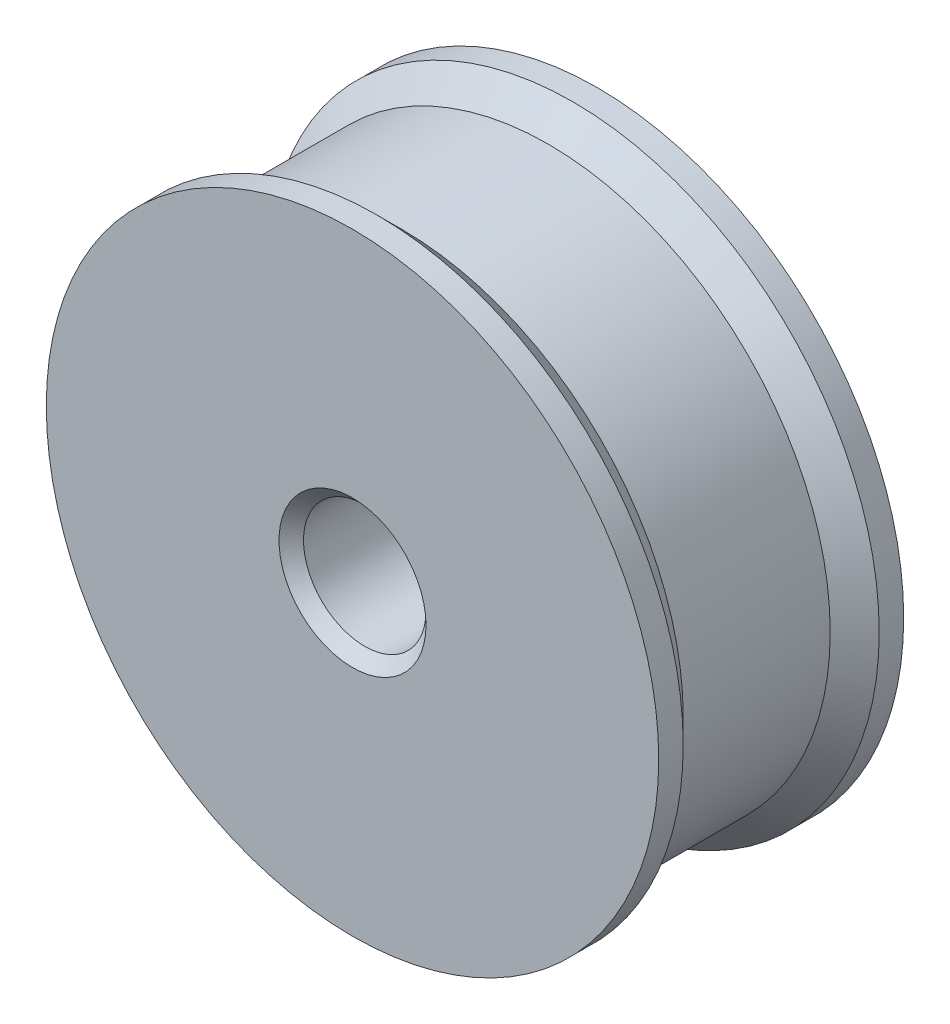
ISO-10303-21;
HEADER;
FILE_DESCRIPTION(('STEP AP214'),'2;1');
FILE_NAME('part.step','',(''),(''),'','','');
FILE_SCHEMA(('AUTOMOTIVE_DESIGN { 1 0 10303 214 1 1 1 1 }'));
ENDSEC;
DATA;
#1=APPLICATION_CONTEXT('core data for automotive mechanical design processes');
#2=APPLICATION_PROTOCOL_DEFINITION('international standard','automotive_design',2000,#1);
#3=PRODUCT_CONTEXT('',#1,'mechanical');
#4=PRODUCT('Part','Part','',(#3));
#5=PRODUCT_RELATED_PRODUCT_CATEGORY('part','',(#4));
#6=PRODUCT_DEFINITION_FORMATION('','',#4);
#7=PRODUCT_DEFINITION_CONTEXT('part definition',#1,'design');
#8=PRODUCT_DEFINITION('design','',#6,#7);
#9=PRODUCT_DEFINITION_SHAPE('','',#8);
#10=(LENGTH_UNIT() NAMED_UNIT(*) SI_UNIT(.MILLI.,.METRE.));
#11=(NAMED_UNIT(*) PLANE_ANGLE_UNIT() SI_UNIT($,.RADIAN.));
#12=(NAMED_UNIT(*) SI_UNIT($,.STERADIAN.) SOLID_ANGLE_UNIT());
#13=UNCERTAINTY_MEASURE_WITH_UNIT(LENGTH_MEASURE(1.E-05),#10,'distance_accuracy_value','');
#14=(GEOMETRIC_REPRESENTATION_CONTEXT(3) GLOBAL_UNCERTAINTY_ASSIGNED_CONTEXT((#13)) GLOBAL_UNIT_ASSIGNED_CONTEXT((#10,
#11,#12)) REPRESENTATION_CONTEXT('',''));
#15=CARTESIAN_POINT('',(0.,0.,0.));
#16=DIRECTION('',(0.,0.,1.));
#17=DIRECTION('',(1.,0.,0.));
#18=AXIS2_PLACEMENT_3D('',#15,#16,#17);
#19=CARTESIAN_POINT('',(0.,0.,10.));
#20=DIRECTION('',(0.,0.,-1.));
#21=DIRECTION('',(-1.,0.,0.));
#22=AXIS2_PLACEMENT_3D('',#19,#20,#21);
#23=CYLINDRICAL_SURFACE('',#22,12.5);
#24=CARTESIAN_POINT('',(0.,0.,10.));
#25=DIRECTION('',(0.,0.,1.));
#26=DIRECTION('',(1.,0.,0.));
#27=AXIS2_PLACEMENT_3D('',#24,#25,#26);
#28=CIRCLE('',#27,12.5);
#29=CARTESIAN_POINT('',(12.5,0.,10.));
#30=VERTEX_POINT('',#29);
#31=EDGE_CURVE('E76',#30,#30,#28,.T.);
#32=ORIENTED_EDGE('',*,*,#31,.F.);
#33=EDGE_LOOP('',(#32));
#34=FACE_BOUND('',#33,.T.);
#35=CARTESIAN_POINT('',(0.,0.,9.));
#36=DIRECTION('',(0.,0.,-1.));
#37=DIRECTION('',(-1.,0.,0.));
#38=AXIS2_PLACEMENT_3D('',#35,#36,#37);
#39=CIRCLE('',#38,12.5);
#40=CARTESIAN_POINT('',(-12.5,0.,9.));
#41=VERTEX_POINT('',#40);
#42=EDGE_CURVE('E81',#41,#41,#39,.T.);
#43=ORIENTED_EDGE('',*,*,#42,.F.);
#44=EDGE_LOOP('',(#43));
#45=FACE_BOUND('',#44,.T.);
#46=ADVANCED_FACE('F43',(#34,#45),#23,.T.);
#47=CARTESIAN_POINT('',(0.,0.,0.));
#48=DIRECTION('',(0.,0.,1.));
#49=DIRECTION('',(1.,0.,0.));
#50=AXIS2_PLACEMENT_3D('',#47,#48,#49);
#51=CIRCLE('',#50,12.5);
#52=CARTESIAN_POINT('',(12.5,0.,0.));
#53=VERTEX_POINT('',#52);
#54=EDGE_CURVE('E77',#53,#53,#51,.T.);
#55=ORIENTED_EDGE('',*,*,#54,.T.);
#56=EDGE_LOOP('',(#55));
#57=FACE_BOUND('',#56,.T.);
#58=CARTESIAN_POINT('',(0.,0.,0.999999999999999));
#59=DIRECTION('',(0.,0.,-1.));
#60=DIRECTION('',(-1.,0.,0.));
#61=AXIS2_PLACEMENT_3D('',#58,#59,#60);
#62=CIRCLE('',#61,12.5);
#63=CARTESIAN_POINT('',(-12.5,0.,0.999999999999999));
#64=VERTEX_POINT('',#63);
#65=EDGE_CURVE('E88',#64,#64,#62,.T.);
#66=ORIENTED_EDGE('',*,*,#65,.T.);
#67=EDGE_LOOP('',(#66));
#68=FACE_BOUND('',#67,.T.);
#69=ADVANCED_FACE('F93',(#57,#68),#23,.T.);
#70=CARTESIAN_POINT('',(0.,0.,10.));
#71=DIRECTION('',(0.,0.,1.));
#72=DIRECTION('',(1.,0.,0.));
#73=AXIS2_PLACEMENT_3D('',#70,#71,#72);
#74=PLANE('',#73);
#75=CARTESIAN_POINT('',(0.,0.,10.));
#76=DIRECTION('',(0.,0.,1.));
#77=DIRECTION('',(1.,0.,0.));
#78=AXIS2_PLACEMENT_3D('',#75,#76,#77);
#79=CIRCLE('',#78,3.00000000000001);
#80=CARTESIAN_POINT('',(3.00000000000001,0.,10.));
#81=VERTEX_POINT('',#80);
#82=EDGE_CURVE('E57',#81,#81,#79,.F.);
#83=ORIENTED_EDGE('',*,*,#82,.T.);
#84=EDGE_LOOP('',(#83));
#85=FACE_BOUND('',#84,.T.);
#86=ORIENTED_EDGE('',*,*,#31,.T.);
#87=EDGE_LOOP('',(#86));
#88=FACE_BOUND('',#87,.T.);
#89=ADVANCED_FACE('F109',(#85,#88),#74,.T.);
#90=CARTESIAN_POINT('',(0.,0.,0.));
#91=DIRECTION('',(0.,0.,1.));
#92=DIRECTION('',(1.,0.,0.));
#93=AXIS2_PLACEMENT_3D('',#90,#91,#92);
#94=PLANE('',#93);
#95=CARTESIAN_POINT('',(0.,0.,0.));
#96=DIRECTION('',(0.,0.,1.));
#97=DIRECTION('',(1.,0.,0.));
#98=AXIS2_PLACEMENT_3D('',#95,#96,#97);
#99=CIRCLE('',#98,3.);
#100=CARTESIAN_POINT('',(3.,0.,0.));
#101=VERTEX_POINT('',#100);
#102=EDGE_CURVE('E72',#101,#101,#99,.T.);
#103=ORIENTED_EDGE('',*,*,#102,.T.);
#104=EDGE_LOOP('',(#103));
#105=FACE_BOUND('',#104,.T.);
#106=ORIENTED_EDGE('',*,*,#54,.F.);
#107=EDGE_LOOP('',(#106));
#108=FACE_BOUND('',#107,.T.);
#109=ADVANCED_FACE('F115',(#105,#108),#94,.F.);
#110=CARTESIAN_POINT('',(0.,0.,10.));
#111=DIRECTION('',(0.,0.,-1.));
#112=DIRECTION('',(-1.,0.,0.));
#113=AXIS2_PLACEMENT_3D('',#110,#111,#112);
#114=CYLINDRICAL_SURFACE('',#113,2.5);
#115=CARTESIAN_POINT('',(0.,0.,0.5));
#116=DIRECTION('',(0.,0.,1.));
#117=DIRECTION('',(1.,0.,0.));
#118=AXIS2_PLACEMENT_3D('',#115,#116,#117);
#119=CIRCLE('',#118,2.5);
#120=CARTESIAN_POINT('',(2.5,0.,0.5));
#121=VERTEX_POINT('',#120);
#122=EDGE_CURVE('E62',#121,#121,#119,.F.);
#123=ORIENTED_EDGE('',*,*,#122,.T.);
#124=EDGE_LOOP('',(#123));
#125=FACE_BOUND('',#124,.T.);
#126=CARTESIAN_POINT('',(0.,0.,9.5));
#127=DIRECTION('',(0.,0.,1.));
#128=DIRECTION('',(1.,0.,0.));
#129=AXIS2_PLACEMENT_3D('',#126,#127,#128);
#130=CIRCLE('',#129,2.5);
#131=CARTESIAN_POINT('',(2.5,0.,9.5));
#132=VERTEX_POINT('',#131);
#133=EDGE_CURVE('E68',#132,#132,#130,.T.);
#134=ORIENTED_EDGE('',*,*,#133,.T.);
#135=EDGE_LOOP('',(#134));
#136=FACE_BOUND('',#135,.T.);
#137=ADVANCED_FACE('F125',(#125,#136),#114,.F.);
#138=CARTESIAN_POINT('',(0.,0.,0.));
#139=DIRECTION('',(0.,0.,-1.));
#140=DIRECTION('',(-1.,0.,0.));
#141=AXIS2_PLACEMENT_3D('',#138,#139,#140);
#142=CONICAL_SURFACE('',#141,3.,0.785398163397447);
#143=ORIENTED_EDGE('',*,*,#122,.F.);
#144=EDGE_LOOP('',(#143));
#145=FACE_BOUND('',#144,.T.);
#146=ORIENTED_EDGE('',*,*,#102,.F.);
#147=EDGE_LOOP('',(#146));
#148=FACE_BOUND('',#147,.T.);
#149=ADVANCED_FACE('F118',(#145,#148),#142,.F.);
#150=CARTESIAN_POINT('',(0.,0.,9.5));
#151=DIRECTION('',(0.,0.,1.));
#152=DIRECTION('',(1.,0.,0.));
#153=AXIS2_PLACEMENT_3D('',#150,#151,#152);
#154=CONICAL_SURFACE('',#153,2.5,0.78539816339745);
#155=ORIENTED_EDGE('',*,*,#82,.F.);
#156=EDGE_LOOP('',(#155));
#157=FACE_BOUND('',#156,.T.);
#158=ORIENTED_EDGE('',*,*,#133,.F.);
#159=EDGE_LOOP('',(#158));
#160=FACE_BOUND('',#159,.T.);
#161=ADVANCED_FACE('F124',(#157,#160),#154,.F.);
#162=CARTESIAN_POINT('',(0.,0.,-3.4751181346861));
#163=DIRECTION('',(0.,0.,-1.));
#164=DIRECTION('',(-1.,0.,0.));
#165=AXIS2_PLACEMENT_3D('',#162,#163,#164);
#166=CYLINDRICAL_SURFACE('',#165,11.5);
#167=CARTESIAN_POINT('',(0.,0.,8.));
#168=DIRECTION('',(0.,0.,-1.));
#169=DIRECTION('',(-1.,0.,0.));
#170=AXIS2_PLACEMENT_3D('',#167,#168,#169);
#171=CIRCLE('',#170,11.5);
#172=CARTESIAN_POINT('',(-11.5,0.,8.));
#173=VERTEX_POINT('',#172);
#174=EDGE_CURVE('E10',#173,#173,#171,.T.);
#175=ORIENTED_EDGE('',*,*,#174,.T.);
#176=EDGE_LOOP('',(#175));
#177=FACE_BOUND('',#176,.T.);
#178=CARTESIAN_POINT('',(0.,0.,2.));
#179=DIRECTION('',(0.,0.,1.));
#180=DIRECTION('',(1.,0.,0.));
#181=AXIS2_PLACEMENT_3D('',#178,#179,#180);
#182=CIRCLE('',#181,11.5);
#183=CARTESIAN_POINT('',(11.5,0.,2.));
#184=VERTEX_POINT('',#183);
#185=EDGE_CURVE('E52',#184,#184,#182,.T.);
#186=ORIENTED_EDGE('',*,*,#185,.T.);
#187=EDGE_LOOP('',(#186));
#188=FACE_BOUND('',#187,.T.);
#189=ADVANCED_FACE('F101',(#177,#188),#166,.T.);
#190=CARTESIAN_POINT('',(0.,0.,8.));
#191=DIRECTION('',(0.,0.,1.));
#192=DIRECTION('',(1.,0.,0.));
#193=AXIS2_PLACEMENT_3D('',#190,#191,#192);
#194=CONICAL_SURFACE('',#193,11.5,0.785398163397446);
#195=ORIENTED_EDGE('',*,*,#42,.T.);
#196=EDGE_LOOP('',(#195));
#197=FACE_BOUND('',#196,.T.);
#198=ORIENTED_EDGE('',*,*,#174,.F.);
#199=EDGE_LOOP('',(#198));
#200=FACE_BOUND('',#199,.T.);
#201=ADVANCED_FACE('F96',(#197,#200),#194,.T.);
#202=CARTESIAN_POINT('',(0.,0.,1.));
#203=DIRECTION('',(0.,0.,-1.));
#204=DIRECTION('',(-1.,0.,0.));
#205=AXIS2_PLACEMENT_3D('',#202,#203,#204);
#206=CONICAL_SURFACE('',#205,12.5,0.785398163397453);
#207=ORIENTED_EDGE('',*,*,#185,.F.);
#208=EDGE_LOOP('',(#207));
#209=FACE_BOUND('',#208,.T.);
#210=ORIENTED_EDGE('',*,*,#65,.F.);
#211=EDGE_LOOP('',(#210));
#212=FACE_BOUND('',#211,.T.);
#213=ADVANCED_FACE('F46',(#209,#212),#206,.T.);
#214=CLOSED_SHELL('',(#46,#69,#89,#109,#137,#149,#161,#189,#201,#213));
#215=MANIFOLD_SOLID_BREP('B2',#214);
#216=ADVANCED_BREP_SHAPE_REPRESENTATION('',(#18,#215),#14);
#217=SHAPE_DEFINITION_REPRESENTATION(#9,#216);
ENDSEC;
END-ISO-10303-21;
